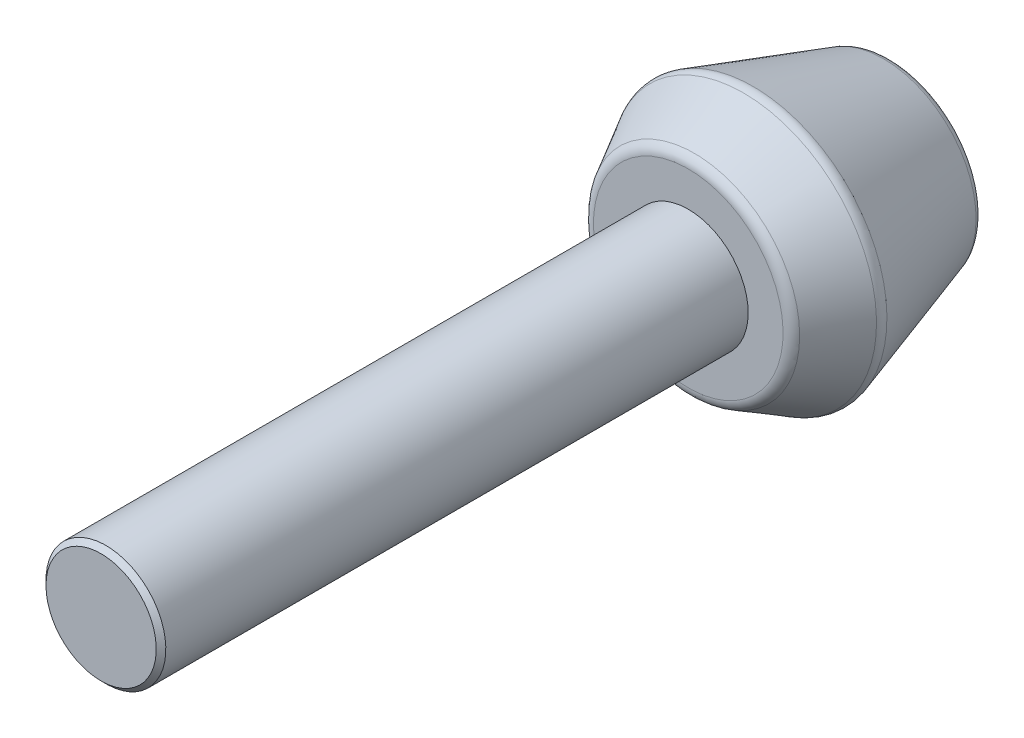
ISO-10303-21;
HEADER;
FILE_DESCRIPTION(('STEP AP214'),'2;1');
FILE_NAME('part.step','',(''),(''),'','','');
FILE_SCHEMA(('AUTOMOTIVE_DESIGN { 1 0 10303 214 1 1 1 1 }'));
ENDSEC;
DATA;
#1=APPLICATION_CONTEXT('core data for automotive mechanical design processes');
#2=APPLICATION_PROTOCOL_DEFINITION('international standard','automotive_design',2000,#1);
#3=PRODUCT_CONTEXT('',#1,'mechanical');
#4=PRODUCT('Part','Part','',(#3));
#5=PRODUCT_RELATED_PRODUCT_CATEGORY('part','',(#4));
#6=PRODUCT_DEFINITION_FORMATION('','',#4);
#7=PRODUCT_DEFINITION_CONTEXT('part definition',#1,'design');
#8=PRODUCT_DEFINITION('design','',#6,#7);
#9=PRODUCT_DEFINITION_SHAPE('','',#8);
#10=(LENGTH_UNIT() NAMED_UNIT(*) SI_UNIT(.MILLI.,.METRE.));
#11=(NAMED_UNIT(*) PLANE_ANGLE_UNIT() SI_UNIT($,.RADIAN.));
#12=(NAMED_UNIT(*) SI_UNIT($,.STERADIAN.) SOLID_ANGLE_UNIT());
#13=UNCERTAINTY_MEASURE_WITH_UNIT(LENGTH_MEASURE(1.E-05),#10,'distance_accuracy_value','');
#14=(GEOMETRIC_REPRESENTATION_CONTEXT(3) GLOBAL_UNCERTAINTY_ASSIGNED_CONTEXT((#13)) GLOBAL_UNIT_ASSIGNED_CONTEXT((#10,
#11,#12)) REPRESENTATION_CONTEXT('',''));
#15=CARTESIAN_POINT('',(0.,0.,0.));
#16=DIRECTION('',(0.,0.,1.));
#17=DIRECTION('',(1.,0.,0.));
#18=AXIS2_PLACEMENT_3D('',#15,#16,#17);
#19=CARTESIAN_POINT('',(6.06615460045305,7.29992107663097,8.5));
#20=DIRECTION('',(0.,0.,-1.));
#21=DIRECTION('',(0.769107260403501,-0.639119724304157,0.));
#22=AXIS2_PLACEMENT_3D('',#19,#20,#21);
#23=PLANE('',#22);
#24=CARTESIAN_POINT('',(0.,0.,8.5));
#25=DIRECTION('',(0.,0.,1.));
#26=DIRECTION('',(-0.769107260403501,0.639119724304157,0.));
#27=AXIS2_PLACEMENT_3D('',#24,#25,#26);
#28=CIRCLE('',#27,2.5);
#29=CARTESIAN_POINT('',(-1.92276815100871,1.59779931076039,8.5));
#30=VERTEX_POINT('',#29);
#31=EDGE_CURVE('E48',#30,#30,#28,.T.);
#32=ORIENTED_EDGE('',*,*,#31,.F.);
#33=EDGE_LOOP('',(#32));
#34=FACE_BOUND('',#33,.T.);
#35=CARTESIAN_POINT('',(0.,0.,8.5));
#36=DIRECTION('',(0.,0.,-1.));
#37=DIRECTION('',(0.769107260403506,-0.639119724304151,0.));
#38=AXIS2_PLACEMENT_3D('',#35,#36,#37);
#39=CIRCLE('',#38,3.95693804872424);
#40=CARTESIAN_POINT('',(3.04330978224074,-2.52895715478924,8.5));
#41=VERTEX_POINT('',#40);
#42=CARTESIAN_POINT('',(-3.04330978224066,2.52895715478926,8.5));
#43=VERTEX_POINT('',#42);
#44=EDGE_CURVE('E41',#41,#43,#39,.T.);
#45=ORIENTED_EDGE('',*,*,#44,.F.);
#46=CARTESIAN_POINT('',(0.,0.,8.5));
#47=DIRECTION('',(0.,0.,-1.));
#48=DIRECTION('',(-0.769107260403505,0.639119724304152,0.));
#49=AXIS2_PLACEMENT_3D('',#46,#47,#48);
#50=CIRCLE('',#49,3.95693804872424);
#51=EDGE_CURVE('E44',#43,#41,#50,.T.);
#52=ORIENTED_EDGE('',*,*,#51,.F.);
#53=EDGE_LOOP('',(#45,#52));
#54=FACE_BOUND('',#53,.T.);
#55=ADVANCED_FACE('F14',(#34,#54),#23,.F.);
#56=CARTESIAN_POINT('',(0.,0.,8.));
#57=DIRECTION('',(0.,0.,-1.));
#58=DIRECTION('',(0.769107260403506,-0.639119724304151,0.));
#59=AXIS2_PLACEMENT_3D('',#56,#57,#58);
#60=TOROIDAL_SURFACE('',#59,3.95693804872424,0.5);
#61=CARTESIAN_POINT('',(0.,0.,8.24430168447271));
#62=DIRECTION('',(0.,0.,-1.));
#63=DIRECTION('',(0.769107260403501,-0.639119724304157,0.));
#64=AXIS2_PLACEMENT_3D('',#61,#62,#63);
#65=CIRCLE('',#64,4.39319105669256);
#66=CARTESIAN_POINT('',(3.378835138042,-2.80777505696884,8.24430168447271));
#67=VERTEX_POINT('',#66);
#68=EDGE_CURVE('E53',#67,#67,#65,.T.);
#69=ORIENTED_EDGE('',*,*,#68,.F.);
#70=EDGE_LOOP('',(#69));
#71=FACE_BOUND('',#70,.T.);
#72=ORIENTED_EDGE('',*,*,#44,.T.);
#73=ORIENTED_EDGE('',*,*,#51,.T.);
#74=EDGE_LOOP('',(#72,#73));
#75=FACE_BOUND('',#74,.T.);
#76=ADVANCED_FACE('F52',(#71,#75),#60,.T.);
#77=CARTESIAN_POINT('',(0.,0.,0.));
#78=DIRECTION('',(0.,0.,-1.));
#79=DIRECTION('',(0.769107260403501,-0.639119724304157,0.));
#80=AXIS2_PLACEMENT_3D('',#77,#78,#79);
#81=PLANE('',#80);
#82=CARTESIAN_POINT('',(0.,0.,0.));
#83=DIRECTION('',(0.,0.,1.));
#84=DIRECTION('',(-0.769107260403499,0.63911972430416,0.));
#85=AXIS2_PLACEMENT_3D('',#82,#83,#84);
#86=CIRCLE('',#85,3.38386270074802);
#87=CARTESIAN_POINT('',(-2.60255337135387,2.1626933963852,0.));
#88=VERTEX_POINT('',#87);
#89=CARTESIAN_POINT('',(2.60255337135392,-2.1626933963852,0.));
#90=VERTEX_POINT('',#89);
#91=EDGE_CURVE('E118',#88,#90,#86,.T.);
#92=ORIENTED_EDGE('',*,*,#91,.F.);
#93=CARTESIAN_POINT('',(0.,0.,0.));
#94=DIRECTION('',(0.,0.,1.));
#95=DIRECTION('',(0.769107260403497,-0.639119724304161,0.));
#96=AXIS2_PLACEMENT_3D('',#93,#94,#95);
#97=CIRCLE('',#96,3.38386270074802);
#98=EDGE_CURVE('E32',#90,#88,#97,.T.);
#99=ORIENTED_EDGE('',*,*,#98,.F.);
#100=EDGE_LOOP('',(#92,#99));
#101=FACE_BOUND('',#100,.T.);
#102=ADVANCED_FACE('F72',(#101),#81,.T.);
#103=CARTESIAN_POINT('',(0.,0.,6.18887432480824));
#104=DIRECTION('',(0.,0.,-1.));
#105=DIRECTION('',(0.769107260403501,-0.639119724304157,0.));
#106=AXIS2_PLACEMENT_3D('',#103,#104,#105);
#107=CONICAL_SURFACE('',#106,5.54423037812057,0.510488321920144);
#108=CARTESIAN_POINT('',(0.,0.,6.18887432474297));
#109=DIRECTION('',(0.,0.,-1.));
#110=DIRECTION('',(0.769107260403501,-0.639119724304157,0.));
#111=AXIS2_PLACEMENT_3D('',#108,#109,#110);
#112=CIRCLE('',#111,5.54423037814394);
#113=CARTESIAN_POINT('',(4.26410783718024,-3.54342699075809,6.18887432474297));
#114=VERTEX_POINT('',#113);
#115=EDGE_CURVE('E90',#114,#114,#112,.T.);
#116=ORIENTED_EDGE('',*,*,#115,.F.);
#117=EDGE_LOOP('',(#116));
#118=FACE_BOUND('',#117,.T.);
#119=ORIENTED_EDGE('',*,*,#68,.T.);
#120=EDGE_LOOP('',(#119));
#121=FACE_BOUND('',#120,.T.);
#122=ADVANCED_FACE('F107',(#118,#121),#107,.T.);
#123=CARTESIAN_POINT('',(0.,0.,0.500000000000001));
#124=DIRECTION('',(0.,0.,-1.));
#125=DIRECTION('',(0.7691072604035,-0.639119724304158,0.));
#126=AXIS2_PLACEMENT_3D('',#123,#124,#125);
#127=TOROIDAL_SURFACE('',#126,3.38386270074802,0.5);
#128=ORIENTED_EDGE('',*,*,#98,.T.);
#129=ORIENTED_EDGE('',*,*,#91,.T.);
#130=EDGE_LOOP('',(#128,#129));
#131=FACE_BOUND('',#130,.T.);
#132=CARTESIAN_POINT('',(0.,0.,0.349054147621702));
#133=DIRECTION('',(0.,0.,1.));
#134=DIRECTION('',(-0.769107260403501,0.639119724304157,0.));
#135=AXIS2_PLACEMENT_3D('',#132,#133,#134);
#136=CIRCLE('',#135,3.86053381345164);
#137=CARTESIAN_POINT('',(-2.96916458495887,2.46734330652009,0.349054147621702));
#138=VERTEX_POINT('',#137);
#139=EDGE_CURVE('E24',#138,#138,#136,.T.);
#140=ORIENTED_EDGE('',*,*,#139,.F.);
#141=EDGE_LOOP('',(#140));
#142=FACE_BOUND('',#141,.T.);
#143=ADVANCED_FACE('F96',(#131,#142),#127,.T.);
#144=CARTESIAN_POINT('',(0.,0.,5.94457264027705));
#145=DIRECTION('',(0.,0.,-1.));
#146=DIRECTION('',(0.769107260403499,-0.639119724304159,0.));
#147=AXIS2_PLACEMENT_3D('',#144,#145,#146);
#148=TOROIDAL_SURFACE('',#147,5.10797737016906,0.5);
#149=CARTESIAN_POINT('',(0.,0.,5.79362678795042));
#150=DIRECTION('',(0.,0.,1.));
#151=DIRECTION('',(-0.769107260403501,0.639119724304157,0.));
#152=AXIS2_PLACEMENT_3D('',#149,#150,#151);
#153=CIRCLE('',#152,5.58464848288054);
#154=CARTESIAN_POINT('',(-4.29519369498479,3.56925899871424,5.79362678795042));
#155=VERTEX_POINT('',#154);
#156=EDGE_CURVE('E9',#155,#155,#153,.F.);
#157=ORIENTED_EDGE('',*,*,#156,.F.);
#158=EDGE_LOOP('',(#157));
#159=FACE_BOUND('',#158,.T.);
#160=ORIENTED_EDGE('',*,*,#115,.T.);
#161=EDGE_LOOP('',(#160));
#162=FACE_BOUND('',#161,.T.);
#163=ADVANCED_FACE('F106',(#159,#162),#148,.T.);
#164=CARTESIAN_POINT('',(0.,0.,5.79362678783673));
#165=DIRECTION('',(0.,0.,1.));
#166=DIRECTION('',(-0.769107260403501,0.639119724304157,0.));
#167=AXIS2_PLACEMENT_3D('',#164,#165,#166);
#168=CONICAL_SURFACE('',#167,5.58464848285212,0.306676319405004);
#169=ORIENTED_EDGE('',*,*,#156,.T.);
#170=EDGE_LOOP('',(#169));
#171=FACE_BOUND('',#170,.T.);
#172=ORIENTED_EDGE('',*,*,#139,.T.);
#173=EDGE_LOOP('',(#172));
#174=FACE_BOUND('',#173,.T.);
#175=ADVANCED_FACE('F162',(#171,#174),#168,.T.);
#176=CARTESIAN_POINT('',(0.,0.,33.));
#177=DIRECTION('',(0.,0.,-1.));
#178=DIRECTION('',(0.692363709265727,-0.721548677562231,0.));
#179=AXIS2_PLACEMENT_3D('',#176,#177,#178);
#180=PLANE('',#179);
#181=CARTESIAN_POINT('',(0.,0.,33.));
#182=DIRECTION('',(0.,0.,-1.));
#183=DIRECTION('',(0.692363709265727,-0.721548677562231,0.));
#184=AXIS2_PLACEMENT_3D('',#181,#182,#183);
#185=CIRCLE('',#184,2.29999999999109);
#186=CARTESIAN_POINT('',(1.59243653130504,-1.65956195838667,33.));
#187=VERTEX_POINT('',#186);
#188=EDGE_CURVE('E18',#187,#187,#185,.T.);
#189=ORIENTED_EDGE('',*,*,#188,.F.);
#190=EDGE_LOOP('',(#189));
#191=FACE_BOUND('',#190,.T.);
#192=ADVANCED_FACE('F16',(#191),#180,.F.);
#193=CARTESIAN_POINT('',(0.,0.,32.7999999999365));
#194=DIRECTION('',(0.,0.,-1.));
#195=DIRECTION('',(0.692363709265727,-0.721548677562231,0.));
#196=AXIS2_PLACEMENT_3D('',#193,#194,#195);
#197=CONICAL_SURFACE('',#196,2.49999999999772,0.78539816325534);
#198=CARTESIAN_POINT('',(0.,0.,32.8));
#199=DIRECTION('',(0.,0.,1.));
#200=DIRECTION('',(-0.692363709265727,0.721548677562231,0.));
#201=AXIS2_PLACEMENT_3D('',#198,#199,#200);
#202=CIRCLE('',#201,2.5);
#203=CARTESIAN_POINT('',(-1.73090927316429,1.80387169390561,32.8));
#204=VERTEX_POINT('',#203);
#205=EDGE_CURVE('E146',#204,#204,#202,.F.);
#206=ORIENTED_EDGE('',*,*,#205,.F.);
#207=EDGE_LOOP('',(#206));
#208=FACE_BOUND('',#207,.T.);
#209=ORIENTED_EDGE('',*,*,#188,.T.);
#210=EDGE_LOOP('',(#209));
#211=FACE_BOUND('',#210,.T.);
#212=ADVANCED_FACE('F159',(#208,#211),#197,.T.);
#213=CARTESIAN_POINT('',(0.,0.,2.));
#214=DIRECTION('',(0.,0.,1.));
#215=DIRECTION('',(-0.692363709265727,0.721548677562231,0.));
#216=AXIS2_PLACEMENT_3D('',#213,#214,#215);
#217=CYLINDRICAL_SURFACE('',#216,2.5);
#218=ORIENTED_EDGE('',*,*,#205,.T.);
#219=EDGE_LOOP('',(#218));
#220=FACE_BOUND('',#219,.T.);
#221=ORIENTED_EDGE('',*,*,#31,.T.);
#222=EDGE_LOOP('',(#221));
#223=FACE_BOUND('',#222,.T.);
#224=ADVANCED_FACE('F169',(#220,#223),#217,.T.);
#225=CLOSED_SHELL('',(#55,#76,#102,#122,#143,#163,#175,#192,#212,#224));
#226=MANIFOLD_SOLID_BREP('B1',#225);
#227=ADVANCED_BREP_SHAPE_REPRESENTATION('',(#18,#226),#14);
#228=SHAPE_DEFINITION_REPRESENTATION(#9,#227);
ENDSEC;
END-ISO-10303-21;
